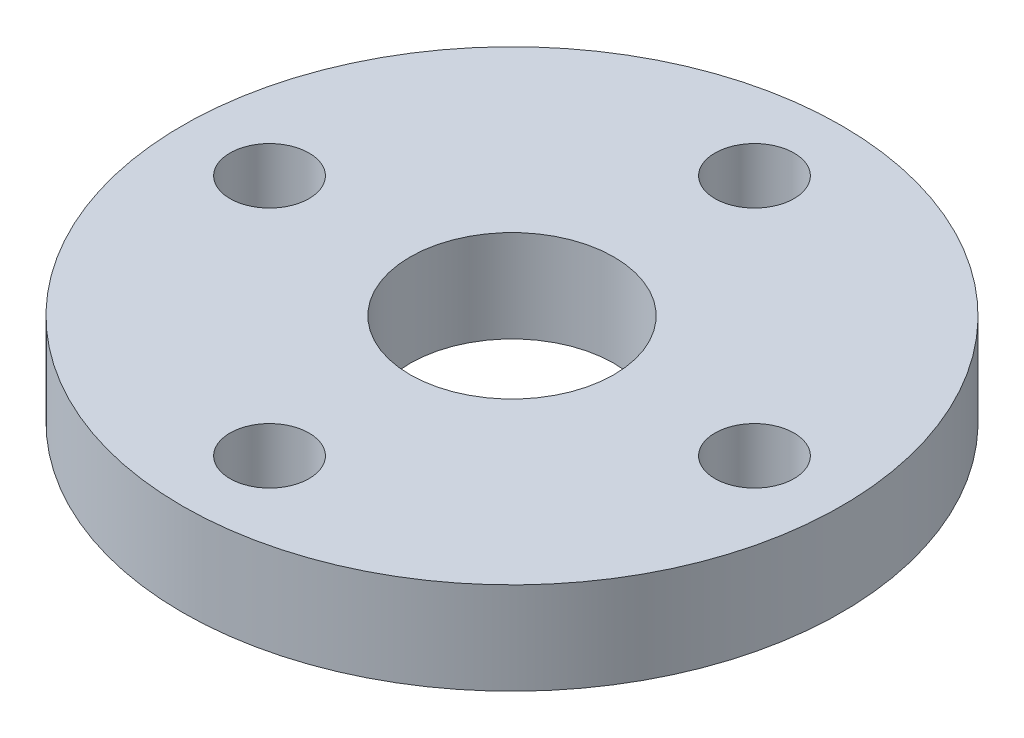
from build123d import *

# Parameters (mm, degrees)
SKETCH1_R          = 53.975
SKETCH1_R_2        = 16.7005
EXTRUDE1_DEPTH     = 15.0876
SKETCH2_R          = 6.477
CUT_EXTRUDE1_DEPTH = 15.0876
CIRPATTERN1_COUNT  = 4


with BuildPart() as part:
    # Sketch1 → Extrude1 (new body)
    with BuildSketch(Plane(origin=(0, 0, 0), x_dir=(1, 0, 0), z_dir=(0, 1, 0))):
        with Locations(Location((0, 0, 0), (0, 0, 270))):
            Circle(SKETCH1_R)
        with Locations(Location((0, 0, 0), (0, 0, 270))):
            Circle(SKETCH1_R_2, mode=Mode.SUBTRACT)
    extrude(amount=EXTRUDE1_DEPTH)

    # Sketch2 → Cut-Extrude1 (cut)
    with BuildSketch(Plane(origin=(0, 15.0876, 0), x_dir=(-1, 0, 0), z_dir=(0, 1, 0))):
        with Locations(Location((0, -39.715647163, 0), (0, 0, 90))):
            Circle(SKETCH2_R)
    cut_extrude1 = extrude(amount=-CUT_EXTRUDE1_DEPTH, mode=Mode.SUBTRACT)

    # CirPattern1: Cut-Extrude1 ×4 about axis
    cirpattern1_axis = Axis((0, 0, 0), (0, 1, 0))
    for i in range(1, CIRPATTERN1_COUNT):
        add(cut_extrude1.rotate(cirpattern1_axis, i * 360 / CIRPATTERN1_COUNT), mode=Mode.SUBTRACT)


solid = part.part
